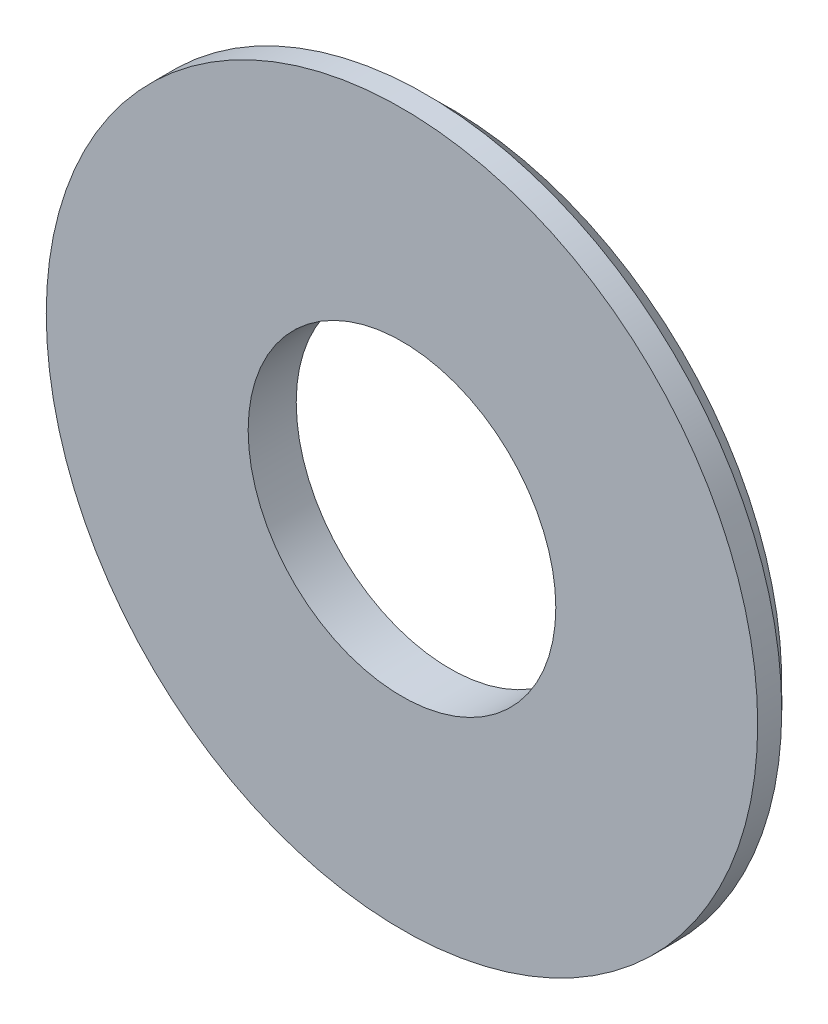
ISO-10303-21;
HEADER;
FILE_DESCRIPTION(('STEP AP214'),'2;1');
FILE_NAME('part.step','',(''),(''),'','','');
FILE_SCHEMA(('AUTOMOTIVE_DESIGN { 1 0 10303 214 1 1 1 1 }'));
ENDSEC;
DATA;
#1=APPLICATION_CONTEXT('core data for automotive mechanical design processes');
#2=APPLICATION_PROTOCOL_DEFINITION('international standard','automotive_design',2000,#1);
#3=PRODUCT_CONTEXT('',#1,'mechanical');
#4=PRODUCT('Part','Part','',(#3));
#5=PRODUCT_RELATED_PRODUCT_CATEGORY('part','',(#4));
#6=PRODUCT_DEFINITION_FORMATION('','',#4);
#7=PRODUCT_DEFINITION_CONTEXT('part definition',#1,'design');
#8=PRODUCT_DEFINITION('design','',#6,#7);
#9=PRODUCT_DEFINITION_SHAPE('','',#8);
#10=(LENGTH_UNIT() NAMED_UNIT(*) SI_UNIT(.MILLI.,.METRE.));
#11=(NAMED_UNIT(*) PLANE_ANGLE_UNIT() SI_UNIT($,.RADIAN.));
#12=(NAMED_UNIT(*) SI_UNIT($,.STERADIAN.) SOLID_ANGLE_UNIT());
#13=UNCERTAINTY_MEASURE_WITH_UNIT(LENGTH_MEASURE(1.E-05),#10,'distance_accuracy_value','');
#14=(GEOMETRIC_REPRESENTATION_CONTEXT(3) GLOBAL_UNCERTAINTY_ASSIGNED_CONTEXT((#13)) GLOBAL_UNIT_ASSIGNED_CONTEXT((#10,
#11,#12)) REPRESENTATION_CONTEXT('',''));
#15=CARTESIAN_POINT('',(0.,0.,0.));
#16=DIRECTION('',(0.,0.,1.));
#17=DIRECTION('',(1.,0.,0.));
#18=AXIS2_PLACEMENT_3D('',#15,#16,#17);
#19=CARTESIAN_POINT('',(-804.677256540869,25.340278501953,-108.123824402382));
#20=DIRECTION('',(0.,0.,-1.));
#21=DIRECTION('',(-1.,0.,0.));
#22=AXIS2_PLACEMENT_3D('',#19,#20,#21);
#23=PLANE('',#22);
#24=CARTESIAN_POINT('',(-806.277256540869,25.340278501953,-108.123824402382));
#25=DIRECTION('',(0.,0.,-1.));
#26=DIRECTION('',(-1.,0.,0.));
#27=AXIS2_PLACEMENT_3D('',#24,#25,#26);
#28=CIRCLE('',#27,3.45000000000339);
#29=CARTESIAN_POINT('',(-809.727256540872,25.340278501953,-108.123824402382));
#30=VERTEX_POINT('',#29);
#31=EDGE_CURVE('E10',#30,#30,#28,.T.);
#32=ORIENTED_EDGE('',*,*,#31,.T.);
#33=EDGE_LOOP('',(#32));
#34=FACE_BOUND('',#33,.T.);
#35=CARTESIAN_POINT('',(-806.277256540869,25.340278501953,-108.123824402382));
#36=DIRECTION('',(0.,0.,-1.));
#37=DIRECTION('',(-1.,0.,0.));
#38=AXIS2_PLACEMENT_3D('',#35,#36,#37);
#39=CIRCLE('',#38,1.60000000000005);
#40=CARTESIAN_POINT('',(-807.877256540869,25.340278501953,-108.123824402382));
#41=VERTEX_POINT('',#40);
#42=EDGE_CURVE('E51',#41,#41,#39,.T.);
#43=ORIENTED_EDGE('',*,*,#42,.F.);
#44=EDGE_LOOP('',(#43));
#45=FACE_BOUND('',#44,.T.);
#46=ADVANCED_FACE('F32',(#34,#45),#23,.T.);
#47=CARTESIAN_POINT('',(-806.277256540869,25.340278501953,-108.123824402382));
#48=DIRECTION('',(0.,0.,1.));
#49=DIRECTION('',(1.,0.,0.));
#50=AXIS2_PLACEMENT_3D('',#47,#48,#49);
#51=CONICAL_SURFACE('',#50,3.45000000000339,0.785398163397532);
#52=CARTESIAN_POINT('',(-806.277256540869,25.340278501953,-107.873824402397));
#53=DIRECTION('',(0.,0.,-1.));
#54=DIRECTION('',(-1.,0.,0.));
#55=AXIS2_PLACEMENT_3D('',#52,#53,#54);
#56=CIRCLE('',#55,3.69999999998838);
#57=CARTESIAN_POINT('',(-809.977256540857,25.340278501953,-107.873824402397));
#58=VERTEX_POINT('',#57);
#59=EDGE_CURVE('E38',#58,#58,#56,.T.);
#60=ORIENTED_EDGE('',*,*,#59,.T.);
#61=EDGE_LOOP('',(#60));
#62=FACE_BOUND('',#61,.T.);
#63=ORIENTED_EDGE('',*,*,#31,.F.);
#64=EDGE_LOOP('',(#63));
#65=FACE_BOUND('',#64,.T.);
#66=ADVANCED_FACE('F59',(#62,#65),#51,.T.);
#67=CARTESIAN_POINT('',(-806.277256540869,25.340278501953,-107.623824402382));
#68=DIRECTION('',(0.,0.,-1.));
#69=DIRECTION('',(-1.,0.,0.));
#70=AXIS2_PLACEMENT_3D('',#67,#68,#69);
#71=CYLINDRICAL_SURFACE('',#70,3.69999999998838);
#72=CARTESIAN_POINT('',(-806.277256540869,25.340278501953,-107.623824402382));
#73=DIRECTION('',(0.,0.,-1.));
#74=DIRECTION('',(-1.,0.,0.));
#75=AXIS2_PLACEMENT_3D('',#72,#73,#74);
#76=CIRCLE('',#75,3.69999999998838);
#77=CARTESIAN_POINT('',(-809.977256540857,25.340278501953,-107.623824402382));
#78=VERTEX_POINT('',#77);
#79=EDGE_CURVE('E42',#78,#78,#76,.T.);
#80=ORIENTED_EDGE('',*,*,#79,.T.);
#81=EDGE_LOOP('',(#80));
#82=FACE_BOUND('',#81,.T.);
#83=ORIENTED_EDGE('',*,*,#59,.F.);
#84=EDGE_LOOP('',(#83));
#85=FACE_BOUND('',#84,.T.);
#86=ADVANCED_FACE('F63',(#82,#85),#71,.T.);
#87=CARTESIAN_POINT('',(-802.577256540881,25.340278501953,-107.623824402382));
#88=DIRECTION('',(0.,0.,1.));
#89=DIRECTION('',(1.,0.,0.));
#90=AXIS2_PLACEMENT_3D('',#87,#88,#89);
#91=PLANE('',#90);
#92=CARTESIAN_POINT('',(-806.277256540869,25.340278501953,-107.623824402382));
#93=DIRECTION('',(0.,0.,-1.));
#94=DIRECTION('',(-1.,0.,0.));
#95=AXIS2_PLACEMENT_3D('',#92,#93,#94);
#96=CIRCLE('',#95,1.60000000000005);
#97=CARTESIAN_POINT('',(-807.877256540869,25.340278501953,-107.623824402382));
#98=VERTEX_POINT('',#97);
#99=EDGE_CURVE('E46',#98,#98,#96,.T.);
#100=ORIENTED_EDGE('',*,*,#99,.T.);
#101=EDGE_LOOP('',(#100));
#102=FACE_BOUND('',#101,.T.);
#103=ORIENTED_EDGE('',*,*,#79,.F.);
#104=EDGE_LOOP('',(#103));
#105=FACE_BOUND('',#104,.T.);
#106=ADVANCED_FACE('F67',(#102,#105),#91,.T.);
#107=CARTESIAN_POINT('',(-806.277256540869,25.340278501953,-107.623824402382));
#108=DIRECTION('',(0.,0.,-1.));
#109=DIRECTION('',(-1.,0.,0.));
#110=AXIS2_PLACEMENT_3D('',#107,#108,#109);
#111=CYLINDRICAL_SURFACE('',#110,1.60000000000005);
#112=ORIENTED_EDGE('',*,*,#42,.T.);
#113=EDGE_LOOP('',(#112));
#114=FACE_BOUND('',#113,.T.);
#115=ORIENTED_EDGE('',*,*,#99,.F.);
#116=EDGE_LOOP('',(#115));
#117=FACE_BOUND('',#116,.T.);
#118=ADVANCED_FACE('F55',(#114,#117),#111,.F.);
#119=CLOSED_SHELL('',(#46,#66,#86,#106,#118));
#120=MANIFOLD_SOLID_BREP('B2',#119);
#121=ADVANCED_BREP_SHAPE_REPRESENTATION('',(#18,#120),#14);
#122=SHAPE_DEFINITION_REPRESENTATION(#9,#121);
ENDSEC;
END-ISO-10303-21;
